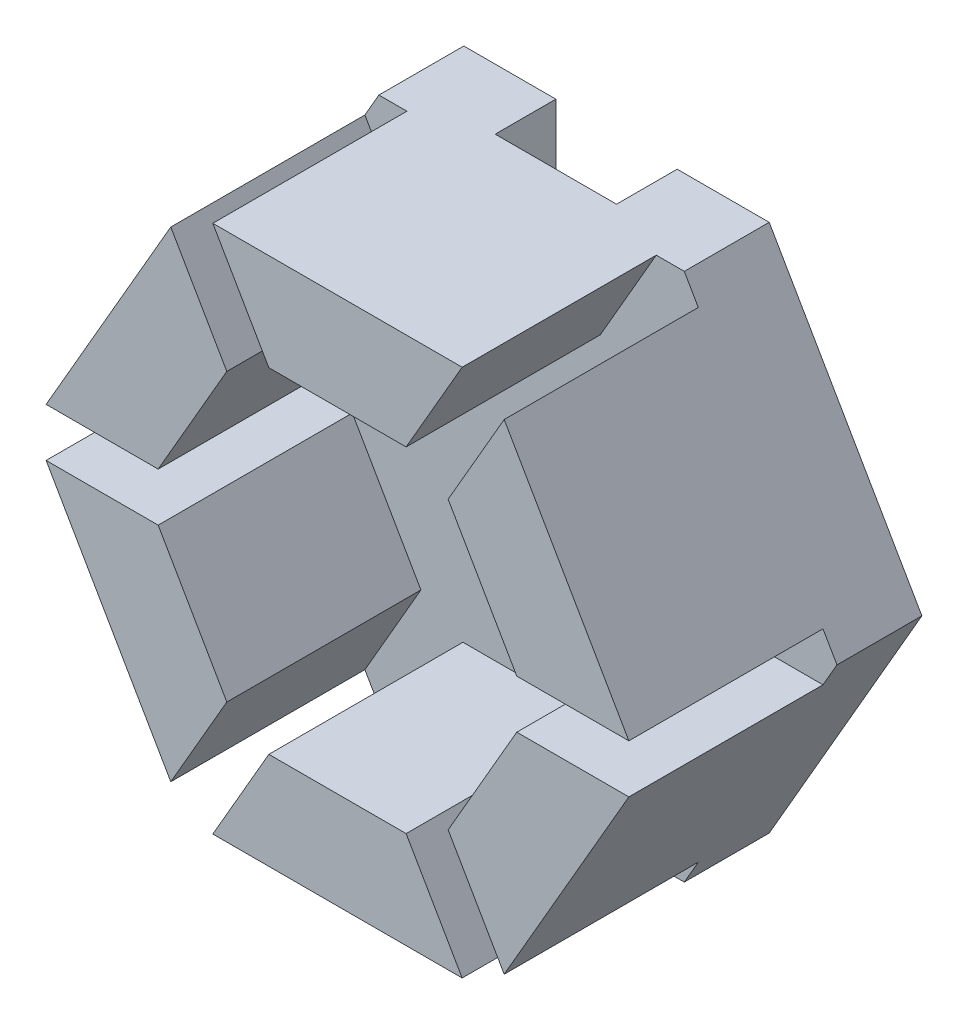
ISO-10303-21;
HEADER;
FILE_DESCRIPTION(('STEP AP214'),'2;1');
FILE_NAME('part.step','',(''),(''),'','','');
FILE_SCHEMA(('AUTOMOTIVE_DESIGN { 1 0 10303 214 1 1 1 1 }'));
ENDSEC;
DATA;
#1=APPLICATION_CONTEXT('core data for automotive mechanical design processes');
#2=APPLICATION_PROTOCOL_DEFINITION('international standard','automotive_design',2000,#1);
#3=PRODUCT_CONTEXT('',#1,'mechanical');
#4=PRODUCT('Part','Part','',(#3));
#5=PRODUCT_RELATED_PRODUCT_CATEGORY('part','',(#4));
#6=PRODUCT_DEFINITION_FORMATION('','',#4);
#7=PRODUCT_DEFINITION_CONTEXT('part definition',#1,'design');
#8=PRODUCT_DEFINITION('design','',#6,#7);
#9=PRODUCT_DEFINITION_SHAPE('','',#8);
#10=(LENGTH_UNIT() NAMED_UNIT(*) SI_UNIT(.MILLI.,.METRE.));
#11=(NAMED_UNIT(*) PLANE_ANGLE_UNIT() SI_UNIT($,.RADIAN.));
#12=(NAMED_UNIT(*) SI_UNIT($,.STERADIAN.) SOLID_ANGLE_UNIT());
#13=UNCERTAINTY_MEASURE_WITH_UNIT(LENGTH_MEASURE(1.E-05),#10,'distance_accuracy_value','');
#14=(GEOMETRIC_REPRESENTATION_CONTEXT(3) GLOBAL_UNCERTAINTY_ASSIGNED_CONTEXT((#13)) GLOBAL_UNIT_ASSIGNED_CONTEXT((#10,
#11,#12)) REPRESENTATION_CONTEXT('',''));
#15=CARTESIAN_POINT('',(0.,0.,0.));
#16=DIRECTION('',(0.,0.,1.));
#17=DIRECTION('',(1.,0.,0.));
#18=AXIS2_PLACEMENT_3D('',#15,#16,#17);
#19=CARTESIAN_POINT('',(0.,0.,4.));
#20=DIRECTION('',(0.,0.,1.));
#21=DIRECTION('',(1.,0.,0.));
#22=AXIS2_PLACEMENT_3D('',#19,#20,#21);
#23=PLANE('',#22);
#24=DIRECTION('',(-0.499999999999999,-0.866025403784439,0.));
#25=VECTOR('',#24,1.);
#26=CARTESIAN_POINT('',(-3.43523410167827,-4.95000000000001,4.));
#27=LINE('',#26,#25);
#28=CARTESIAN_POINT('',(-2.28053356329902,-2.95,4.));
#29=VERTEX_POINT('',#28);
#30=CARTESIAN_POINT('',(-3.43523410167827,-4.95000000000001,4.));
#31=VERTEX_POINT('',#30);
#32=EDGE_CURVE('E265',#29,#31,#27,.T.);
#33=ORIENTED_EDGE('',*,*,#32,.F.);
#34=DIRECTION('',(0.5,-0.866025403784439,0.));
#35=VECTOR('',#34,1.);
#36=CARTESIAN_POINT('',(-3.98371685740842,0.,4.));
#37=LINE('',#36,#35);
#38=CARTESIAN_POINT('',(-3.69504172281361,-0.5,4.));
#39=VERTEX_POINT('',#38);
#40=EDGE_CURVE('E342',#39,#29,#37,.T.);
#41=ORIENTED_EDGE('',*,*,#40,.F.);
#42=DIRECTION('',(1.,0.,0.));
#43=VECTOR('',#42,1.);
#44=CARTESIAN_POINT('',(-6.00444279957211,-0.500000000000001,4.));
#45=LINE('',#44,#43);
#46=CARTESIAN_POINT('',(-6.00444279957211,-0.500000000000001,4.));
#47=VERTEX_POINT('',#46);
#48=EDGE_CURVE('E478',#47,#39,#45,.T.);
#49=ORIENTED_EDGE('',*,*,#48,.F.);
#50=DIRECTION('',(0.5,-0.866025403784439,0.));
#51=VECTOR('',#50,1.);
#52=CARTESIAN_POINT('',(-6.29311793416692,0.,4.));
#53=LINE('',#52,#51);
#54=EDGE_CURVE('E365',#47,#31,#53,.T.);
#55=ORIENTED_EDGE('',*,*,#54,.T.);
#56=EDGE_LOOP('',(#33,#41,#49,#55));
#57=FACE_BOUND('',#56,.T.);
#58=ADVANCED_FACE('F37',(#57),#23,.T.);
#59=DIRECTION('',(0.499999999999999,0.866025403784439,0.));
#60=VECTOR('',#59,1.);
#61=CARTESIAN_POINT('',(-2.56920869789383,-5.45000000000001,4.));
#62=LINE('',#61,#60);
#63=CARTESIAN_POINT('',(-2.56920869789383,-5.45000000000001,4.));
#64=VERTEX_POINT('',#63);
#65=CARTESIAN_POINT('',(-1.41450815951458,-3.45,4.));
#66=VERTEX_POINT('',#65);
#67=EDGE_CURVE('E605',#64,#66,#62,.T.);
#68=ORIENTED_EDGE('',*,*,#67,.F.);
#69=DIRECTION('',(1.,0.,0.));
#70=VECTOR('',#69,1.);
#71=CARTESIAN_POINT('',(-3.14655896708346,-5.45,4.));
#72=LINE('',#71,#70);
#73=CARTESIAN_POINT('',(2.56920869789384,-5.45,4.));
#74=VERTEX_POINT('',#73);
#75=EDGE_CURVE('E368',#64,#74,#72,.T.);
#76=ORIENTED_EDGE('',*,*,#75,.T.);
#77=DIRECTION('',(0.5,-0.866025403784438,0.));
#78=VECTOR('',#77,1.);
#79=CARTESIAN_POINT('',(2.56920869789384,-5.45,4.));
#80=LINE('',#79,#78);
#81=CARTESIAN_POINT('',(1.41450815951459,-3.45,4.));
#82=VERTEX_POINT('',#81);
#83=EDGE_CURVE('E573',#82,#74,#80,.T.);
#84=ORIENTED_EDGE('',*,*,#83,.F.);
#85=DIRECTION('',(1.,0.,0.));
#86=VECTOR('',#85,1.);
#87=CARTESIAN_POINT('',(-1.99185842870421,-3.45,4.));
#88=LINE('',#87,#86);
#89=EDGE_CURVE('E345',#66,#82,#88,.T.);
#90=ORIENTED_EDGE('',*,*,#89,.F.);
#91=EDGE_LOOP('',(#68,#76,#84,#90));
#92=FACE_BOUND('',#91,.T.);
#93=ADVANCED_FACE('F540',(#92),#23,.T.);
#94=DIRECTION('',(0.5,0.866025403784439,0.));
#95=VECTOR('',#94,1.);
#96=CARTESIAN_POINT('',(3.43523410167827,4.95,4.));
#97=LINE('',#96,#95);
#98=CARTESIAN_POINT('',(2.28053356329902,2.95,4.));
#99=VERTEX_POINT('',#98);
#100=CARTESIAN_POINT('',(3.43523410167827,4.95,4.));
#101=VERTEX_POINT('',#100);
#102=EDGE_CURVE('E414',#99,#101,#97,.T.);
#103=ORIENTED_EDGE('',*,*,#102,.F.);
#104=DIRECTION('',(-0.5,0.866025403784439,0.));
#105=VECTOR('',#104,1.);
#106=CARTESIAN_POINT('',(3.98371685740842,0.,4.));
#107=LINE('',#106,#105);
#108=CARTESIAN_POINT('',(3.69504172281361,0.500000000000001,4.));
#109=VERTEX_POINT('',#108);
#110=EDGE_CURVE('E334',#109,#99,#107,.T.);
#111=ORIENTED_EDGE('',*,*,#110,.F.);
#112=DIRECTION('',(-1.,0.,0.));
#113=VECTOR('',#112,1.);
#114=CARTESIAN_POINT('',(6.00444279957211,0.500000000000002,4.));
#115=LINE('',#114,#113);
#116=CARTESIAN_POINT('',(6.00444279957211,0.500000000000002,4.));
#117=VERTEX_POINT('',#116);
#118=EDGE_CURVE('E454',#117,#109,#115,.T.);
#119=ORIENTED_EDGE('',*,*,#118,.F.);
#120=DIRECTION('',(-0.5,0.866025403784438,0.));
#121=VECTOR('',#120,1.);
#122=CARTESIAN_POINT('',(6.29311793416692,0.,4.));
#123=LINE('',#122,#121);
#124=EDGE_CURVE('E347',#117,#101,#123,.T.);
#125=ORIENTED_EDGE('',*,*,#124,.T.);
#126=EDGE_LOOP('',(#103,#111,#119,#125));
#127=FACE_BOUND('',#126,.T.);
#128=ADVANCED_FACE('F547',(#127),#23,.T.);
#129=DIRECTION('',(-0.5,-0.866025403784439,0.));
#130=VECTOR('',#129,1.);
#131=CARTESIAN_POINT('',(2.56920869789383,5.45,4.));
#132=LINE('',#131,#130);
#133=CARTESIAN_POINT('',(2.56920869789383,5.45,4.));
#134=VERTEX_POINT('',#133);
#135=CARTESIAN_POINT('',(1.41450815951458,3.45,4.));
#136=VERTEX_POINT('',#135);
#137=EDGE_CURVE('E418',#134,#136,#132,.T.);
#138=ORIENTED_EDGE('',*,*,#137,.F.);
#139=DIRECTION('',(-1.,0.,0.));
#140=VECTOR('',#139,1.);
#141=CARTESIAN_POINT('',(3.14655896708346,5.45,4.));
#142=LINE('',#141,#140);
#143=CARTESIAN_POINT('',(-2.56920869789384,5.45,4.));
#144=VERTEX_POINT('',#143);
#145=EDGE_CURVE('E361',#134,#144,#142,.T.);
#146=ORIENTED_EDGE('',*,*,#145,.T.);
#147=DIRECTION('',(-0.5,0.866025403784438,0.));
#148=VECTOR('',#147,1.);
#149=CARTESIAN_POINT('',(-2.56920869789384,5.45,4.));
#150=LINE('',#149,#148);
#151=CARTESIAN_POINT('',(-1.41450815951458,3.45,4.));
#152=VERTEX_POINT('',#151);
#153=EDGE_CURVE('E440',#152,#144,#150,.T.);
#154=ORIENTED_EDGE('',*,*,#153,.F.);
#155=DIRECTION('',(-1.,0.,0.));
#156=VECTOR('',#155,1.);
#157=CARTESIAN_POINT('',(1.99185842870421,3.45,4.));
#158=LINE('',#157,#156);
#159=EDGE_CURVE('E338',#136,#152,#158,.T.);
#160=ORIENTED_EDGE('',*,*,#159,.F.);
#161=EDGE_LOOP('',(#138,#146,#154,#160));
#162=FACE_BOUND('',#161,.T.);
#163=ADVANCED_FACE('F561',(#162),#23,.T.);
#164=DIRECTION('',(-0.500000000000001,0.866025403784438,0.));
#165=VECTOR('',#164,1.);
#166=CARTESIAN_POINT('',(3.43523410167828,-4.95,4.));
#167=LINE('',#166,#165);
#168=CARTESIAN_POINT('',(3.43523410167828,-4.95,4.));
#169=VERTEX_POINT('',#168);
#170=CARTESIAN_POINT('',(2.28053356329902,-2.95,4.));
#171=VERTEX_POINT('',#170);
#172=EDGE_CURVE('E569',#169,#171,#167,.T.);
#173=ORIENTED_EDGE('',*,*,#172,.F.);
#174=DIRECTION('',(0.5,0.866025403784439,0.));
#175=VECTOR('',#174,1.);
#176=CARTESIAN_POINT('',(3.14655896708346,-5.45,4.));
#177=LINE('',#176,#175);
#178=CARTESIAN_POINT('',(6.00444279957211,-0.499999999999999,4.));
#179=VERTEX_POINT('',#178);
#180=EDGE_CURVE('E370',#169,#179,#177,.T.);
#181=ORIENTED_EDGE('',*,*,#180,.T.);
#182=DIRECTION('',(1.,0.,0.));
#183=VECTOR('',#182,1.);
#184=CARTESIAN_POINT('',(6.00444279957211,-0.499999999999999,4.));
#185=LINE('',#184,#183);
#186=CARTESIAN_POINT('',(3.69504172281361,-0.499999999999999,4.));
#187=VERTEX_POINT('',#186);
#188=EDGE_CURVE('E464',#187,#179,#185,.T.);
#189=ORIENTED_EDGE('',*,*,#188,.F.);
#190=DIRECTION('',(0.5,0.866025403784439,0.));
#191=VECTOR('',#190,1.);
#192=CARTESIAN_POINT('',(1.99185842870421,-3.45,4.));
#193=LINE('',#192,#191);
#194=EDGE_CURVE('E332',#171,#187,#193,.T.);
#195=ORIENTED_EDGE('',*,*,#194,.F.);
#196=EDGE_LOOP('',(#173,#181,#189,#195));
#197=FACE_BOUND('',#196,.T.);
#198=ADVANCED_FACE('F554',(#197),#23,.T.);
#199=CARTESIAN_POINT('',(0.,0.,-1.75));
#200=DIRECTION('',(0.,0.,-1.));
#201=DIRECTION('',(-1.,0.,0.));
#202=AXIS2_PLACEMENT_3D('',#199,#200,#201);
#203=PLANE('',#202);
#204=DIRECTION('',(0.,-1.,0.));
#205=VECTOR('',#204,1.);
#206=CARTESIAN_POINT('',(1.25,5.45,-1.75));
#207=LINE('',#206,#205);
#208=CARTESIAN_POINT('',(1.25,5.45,-1.75));
#209=VERTEX_POINT('',#208);
#210=CARTESIAN_POINT('',(1.25,-5.45,-1.75));
#211=VERTEX_POINT('',#210);
#212=EDGE_CURVE('E399',#209,#211,#207,.T.);
#213=ORIENTED_EDGE('',*,*,#212,.F.);
#214=DIRECTION('',(1.,0.,0.));
#215=VECTOR('',#214,1.);
#216=CARTESIAN_POINT('',(-3.14655896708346,5.45,-1.75));
#217=LINE('',#216,#215);
#218=CARTESIAN_POINT('',(3.14655896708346,5.45,-1.75));
#219=VERTEX_POINT('',#218);
#220=EDGE_CURVE('E314',#209,#219,#217,.T.);
#221=ORIENTED_EDGE('',*,*,#220,.T.);
#222=DIRECTION('',(0.5,-0.866025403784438,0.));
#223=VECTOR('',#222,1.);
#224=CARTESIAN_POINT('',(3.14655896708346,5.45,-1.75));
#225=LINE('',#224,#223);
#226=CARTESIAN_POINT('',(6.29311793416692,0.,-1.75));
#227=VERTEX_POINT('',#226);
#228=EDGE_CURVE('E313',#219,#227,#225,.T.);
#229=ORIENTED_EDGE('',*,*,#228,.T.);
#230=DIRECTION('',(-0.5,-0.866025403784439,0.));
#231=VECTOR('',#230,1.);
#232=CARTESIAN_POINT('',(6.29311793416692,0.,-1.75));
#233=LINE('',#232,#231);
#234=CARTESIAN_POINT('',(3.14655896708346,-5.45,-1.75));
#235=VERTEX_POINT('',#234);
#236=EDGE_CURVE('E317',#227,#235,#233,.T.);
#237=ORIENTED_EDGE('',*,*,#236,.T.);
#238=DIRECTION('',(-1.,0.,0.));
#239=VECTOR('',#238,1.);
#240=CARTESIAN_POINT('',(3.14655896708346,-5.45,-1.75));
#241=LINE('',#240,#239);
#242=EDGE_CURVE('E328',#235,#211,#241,.T.);
#243=ORIENTED_EDGE('',*,*,#242,.T.);
#244=EDGE_LOOP('',(#213,#221,#229,#237,#243));
#245=FACE_BOUND('',#244,.T.);
#246=ADVANCED_FACE('F385',(#245),#203,.T.);
#247=DIRECTION('',(0.500000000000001,-0.866025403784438,0.));
#248=VECTOR('',#247,1.);
#249=CARTESIAN_POINT('',(-3.43523410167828,4.95,4.));
#250=LINE('',#249,#248);
#251=CARTESIAN_POINT('',(-3.43523410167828,4.95,4.));
#252=VERTEX_POINT('',#251);
#253=CARTESIAN_POINT('',(-2.28053356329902,2.95,4.));
#254=VERTEX_POINT('',#253);
#255=EDGE_CURVE('E431',#252,#254,#250,.T.);
#256=ORIENTED_EDGE('',*,*,#255,.F.);
#257=DIRECTION('',(-0.5,-0.866025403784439,0.));
#258=VECTOR('',#257,1.);
#259=CARTESIAN_POINT('',(-3.14655896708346,5.45,4.));
#260=LINE('',#259,#258);
#261=CARTESIAN_POINT('',(-6.00444279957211,0.499999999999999,4.));
#262=VERTEX_POINT('',#261);
#263=EDGE_CURVE('E363',#252,#262,#260,.T.);
#264=ORIENTED_EDGE('',*,*,#263,.T.);
#265=DIRECTION('',(-1.,0.,0.));
#266=VECTOR('',#265,1.);
#267=CARTESIAN_POINT('',(-6.00444279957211,0.499999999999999,4.));
#268=LINE('',#267,#266);
#269=CARTESIAN_POINT('',(-3.69504172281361,0.499999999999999,4.));
#270=VERTEX_POINT('',#269);
#271=EDGE_CURVE('E489',#270,#262,#268,.T.);
#272=ORIENTED_EDGE('',*,*,#271,.F.);
#273=DIRECTION('',(-0.5,-0.866025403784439,0.));
#274=VECTOR('',#273,1.);
#275=CARTESIAN_POINT('',(-1.99185842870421,3.45,4.));
#276=LINE('',#275,#274);
#277=EDGE_CURVE('E340',#254,#270,#276,.T.);
#278=ORIENTED_EDGE('',*,*,#277,.F.);
#279=EDGE_LOOP('',(#256,#264,#272,#278));
#280=FACE_BOUND('',#279,.T.);
#281=ADVANCED_FACE('F543',(#280),#23,.T.);
#282=CARTESIAN_POINT('',(6.29311793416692,0.,4.));
#283=DIRECTION('',(-0.866025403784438,-0.5,0.));
#284=DIRECTION('',(0.5,-0.866025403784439,0.));
#285=AXIS2_PLACEMENT_3D('',#282,#283,#284);
#286=PLANE('',#285);
#287=DIRECTION('',(-0.500000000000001,0.866025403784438,0.));
#288=VECTOR('',#287,1.);
#289=CARTESIAN_POINT('',(3.43523410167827,4.95,0.));
#290=LINE('',#289,#288);
#291=CARTESIAN_POINT('',(3.43523410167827,4.95,0.));
#292=VERTEX_POINT('',#291);
#293=CARTESIAN_POINT('',(3.14655896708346,5.45,0.));
#294=VERTEX_POINT('',#293);
#295=EDGE_CURVE('E410',#292,#294,#290,.T.);
#296=ORIENTED_EDGE('',*,*,#295,.F.);
#297=DIRECTION('',(0.,0.,1.));
#298=VECTOR('',#297,1.);
#299=CARTESIAN_POINT('',(3.43523410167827,4.95,0.));
#300=LINE('',#299,#298);
#301=EDGE_CURVE('E412',#292,#101,#300,.T.);
#302=ORIENTED_EDGE('',*,*,#301,.T.);
#303=ORIENTED_EDGE('',*,*,#124,.F.);
#304=DIRECTION('',(0.,0.,1.));
#305=VECTOR('',#304,1.);
#306=CARTESIAN_POINT('',(6.00444279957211,0.500000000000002,0.));
#307=LINE('',#306,#305);
#308=CARTESIAN_POINT('',(6.00444279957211,0.500000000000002,0.));
#309=VERTEX_POINT('',#308);
#310=EDGE_CURVE('E471',#309,#117,#307,.T.);
#311=ORIENTED_EDGE('',*,*,#310,.F.);
#312=DIRECTION('',(-0.499999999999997,0.866025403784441,0.));
#313=VECTOR('',#312,1.);
#314=CARTESIAN_POINT('',(6.29311793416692,0.,0.));
#315=LINE('',#314,#313);
#316=CARTESIAN_POINT('',(6.29311793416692,0.,0.));
#317=VERTEX_POINT('',#316);
#318=EDGE_CURVE('E379',#317,#309,#315,.T.);
#319=ORIENTED_EDGE('',*,*,#318,.F.);
#320=DIRECTION('',(0.,0.,-1.));
#321=VECTOR('',#320,1.);
#322=CARTESIAN_POINT('',(6.29311793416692,0.,4.));
#323=LINE('',#322,#321);
#324=EDGE_CURVE('E283',#317,#227,#323,.T.);
#325=ORIENTED_EDGE('',*,*,#324,.T.);
#326=ORIENTED_EDGE('',*,*,#228,.F.);
#327=DIRECTION('',(0.,0.,-1.));
#328=VECTOR('',#327,1.);
#329=CARTESIAN_POINT('',(3.14655896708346,5.45,4.));
#330=LINE('',#329,#328);
#331=EDGE_CURVE('E11',#294,#219,#330,.T.);
#332=ORIENTED_EDGE('',*,*,#331,.F.);
#333=EDGE_LOOP('',(#296,#302,#303,#311,#319,#325,#326,#332));
#334=FACE_BOUND('',#333,.T.);
#335=ADVANCED_FACE('F39',(#334),#286,.F.);
#336=CARTESIAN_POINT('',(3.14655896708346,5.45,4.));
#337=DIRECTION('',(0.,-1.,0.));
#338=DIRECTION('',(1.,0.,0.));
#339=AXIS2_PLACEMENT_3D('',#336,#337,#338);
#340=PLANE('',#339);
#341=ORIENTED_EDGE('',*,*,#145,.F.);
#342=DIRECTION('',(0.,0.,1.));
#343=VECTOR('',#342,1.);
#344=CARTESIAN_POINT('',(2.56920869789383,5.45,0.));
#345=LINE('',#344,#343);
#346=CARTESIAN_POINT('',(2.56920869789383,5.45,0.));
#347=VERTEX_POINT('',#346);
#348=EDGE_CURVE('E427',#347,#134,#345,.T.);
#349=ORIENTED_EDGE('',*,*,#348,.F.);
#350=DIRECTION('',(-1.,0.,0.));
#351=VECTOR('',#350,1.);
#352=CARTESIAN_POINT('',(3.14655896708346,5.45,0.));
#353=LINE('',#352,#351);
#354=EDGE_CURVE('E408',#294,#347,#353,.T.);
#355=ORIENTED_EDGE('',*,*,#354,.F.);
#356=ORIENTED_EDGE('',*,*,#331,.T.);
#357=ORIENTED_EDGE('',*,*,#220,.F.);
#358=DIRECTION('',(0.,0.,-1.));
#359=VECTOR('',#358,1.);
#360=CARTESIAN_POINT('',(1.25,5.45,-0.5));
#361=LINE('',#360,#359);
#362=CARTESIAN_POINT('',(1.25,5.45,-0.5));
#363=VERTEX_POINT('',#362);
#364=EDGE_CURVE('E320',#363,#209,#361,.T.);
#365=ORIENTED_EDGE('',*,*,#364,.F.);
#366=DIRECTION('',(1.,0.,0.));
#367=VECTOR('',#366,1.);
#368=CARTESIAN_POINT('',(1.25,5.45,-0.5));
#369=LINE('',#368,#367);
#370=CARTESIAN_POINT('',(-1.25,5.45,-0.5));
#371=VERTEX_POINT('',#370);
#372=EDGE_CURVE('E519',#371,#363,#369,.T.);
#373=ORIENTED_EDGE('',*,*,#372,.F.);
#374=DIRECTION('',(0.,0.,-1.));
#375=VECTOR('',#374,1.);
#376=CARTESIAN_POINT('',(-1.25,5.45,-0.5));
#377=LINE('',#376,#375);
#378=CARTESIAN_POINT('',(-1.25,5.45,-1.75));
#379=VERTEX_POINT('',#378);
#380=EDGE_CURVE('E312',#371,#379,#377,.T.);
#381=ORIENTED_EDGE('',*,*,#380,.T.);
#382=CARTESIAN_POINT('',(-3.14655896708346,5.45,-1.75));
#383=VERTEX_POINT('',#382);
#384=EDGE_CURVE('E305',#383,#379,#217,.T.);
#385=ORIENTED_EDGE('',*,*,#384,.F.);
#386=DIRECTION('',(0.,0.,-1.));
#387=VECTOR('',#386,1.);
#388=CARTESIAN_POINT('',(-3.14655896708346,5.45,4.));
#389=LINE('',#388,#387);
#390=CARTESIAN_POINT('',(-3.14655896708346,5.45,0.));
#391=VERTEX_POINT('',#390);
#392=EDGE_CURVE('E45',#391,#383,#389,.T.);
#393=ORIENTED_EDGE('',*,*,#392,.F.);
#394=DIRECTION('',(-1.,0.,0.));
#395=VECTOR('',#394,1.);
#396=CARTESIAN_POINT('',(-2.56920869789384,5.45,0.));
#397=LINE('',#396,#395);
#398=CARTESIAN_POINT('',(-2.56920869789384,5.45,0.));
#399=VERTEX_POINT('',#398);
#400=EDGE_CURVE('E438',#399,#391,#397,.T.);
#401=ORIENTED_EDGE('',*,*,#400,.F.);
#402=DIRECTION('',(0.,0.,1.));
#403=VECTOR('',#402,1.);
#404=CARTESIAN_POINT('',(-2.56920869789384,5.45,0.));
#405=LINE('',#404,#403);
#406=EDGE_CURVE('E451',#399,#144,#405,.T.);
#407=ORIENTED_EDGE('',*,*,#406,.T.);
#408=EDGE_LOOP('',(#341,#349,#355,#356,#357,#365,#373,#381,#385,#393,#401,#407));
#409=FACE_BOUND('',#408,.T.);
#410=ADVANCED_FACE('F310',(#409),#340,.F.);
#411=CARTESIAN_POINT('',(-3.14655896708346,5.45,4.));
#412=DIRECTION('',(0.866025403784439,-0.5,0.));
#413=DIRECTION('',(0.5,0.866025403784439,0.));
#414=AXIS2_PLACEMENT_3D('',#411,#412,#413);
#415=PLANE('',#414);
#416=ORIENTED_EDGE('',*,*,#263,.F.);
#417=DIRECTION('',(0.,0.,1.));
#418=VECTOR('',#417,1.);
#419=CARTESIAN_POINT('',(-3.43523410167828,4.95,0.));
#420=LINE('',#419,#418);
#421=CARTESIAN_POINT('',(-3.43523410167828,4.95,0.));
#422=VERTEX_POINT('',#421);
#423=EDGE_CURVE('E447',#422,#252,#420,.T.);
#424=ORIENTED_EDGE('',*,*,#423,.F.);
#425=DIRECTION('',(-0.500000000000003,-0.866025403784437,0.));
#426=VECTOR('',#425,1.);
#427=CARTESIAN_POINT('',(-3.14655896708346,5.45,0.));
#428=LINE('',#427,#426);
#429=EDGE_CURVE('E297',#391,#422,#428,.T.);
#430=ORIENTED_EDGE('',*,*,#429,.F.);
#431=ORIENTED_EDGE('',*,*,#392,.T.);
#432=DIRECTION('',(0.5,0.866025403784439,0.));
#433=VECTOR('',#432,1.);
#434=CARTESIAN_POINT('',(-6.29311793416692,0.,-1.75));
#435=LINE('',#434,#433);
#436=CARTESIAN_POINT('',(-6.29311793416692,0.,-1.75));
#437=VERTEX_POINT('',#436);
#438=EDGE_CURVE('E294',#437,#383,#435,.T.);
#439=ORIENTED_EDGE('',*,*,#438,.F.);
#440=DIRECTION('',(0.,0.,-1.));
#441=VECTOR('',#440,1.);
#442=CARTESIAN_POINT('',(-6.29311793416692,0.,4.));
#443=LINE('',#442,#441);
#444=CARTESIAN_POINT('',(-6.29311793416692,0.,0.));
#445=VERTEX_POINT('',#444);
#446=EDGE_CURVE('E279',#445,#437,#443,.T.);
#447=ORIENTED_EDGE('',*,*,#446,.F.);
#448=DIRECTION('',(-0.499999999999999,-0.866025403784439,0.));
#449=VECTOR('',#448,1.);
#450=CARTESIAN_POINT('',(-6.00444279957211,0.499999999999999,0.));
#451=LINE('',#450,#449);
#452=CARTESIAN_POINT('',(-6.00444279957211,0.499999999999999,0.));
#453=VERTEX_POINT('',#452);
#454=EDGE_CURVE('E486',#453,#445,#451,.T.);
#455=ORIENTED_EDGE('',*,*,#454,.F.);
#456=DIRECTION('',(0.,0.,1.));
#457=VECTOR('',#456,1.);
#458=CARTESIAN_POINT('',(-6.00444279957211,0.499999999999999,0.));
#459=LINE('',#458,#457);
#460=EDGE_CURVE('E402',#453,#262,#459,.T.);
#461=ORIENTED_EDGE('',*,*,#460,.T.);
#462=EDGE_LOOP('',(#416,#424,#430,#431,#439,#447,#455,#461));
#463=FACE_BOUND('',#462,.T.);
#464=ADVANCED_FACE('F292',(#463),#415,.F.);
#465=CARTESIAN_POINT('',(-6.29311793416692,0.,4.));
#466=DIRECTION('',(0.866025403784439,0.5,0.));
#467=DIRECTION('',(-0.5,0.866025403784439,0.));
#468=AXIS2_PLACEMENT_3D('',#465,#466,#467);
#469=PLANE('',#468);
#470=DIRECTION('',(0.500000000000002,-0.866025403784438,0.));
#471=VECTOR('',#470,1.);
#472=CARTESIAN_POINT('',(-3.43523410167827,-4.95000000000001,0.));
#473=LINE('',#472,#471);
#474=CARTESIAN_POINT('',(-3.43523410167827,-4.95000000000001,0.));
#475=VERTEX_POINT('',#474);
#476=CARTESIAN_POINT('',(-3.14655896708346,-5.45,0.));
#477=VERTEX_POINT('',#476);
#478=EDGE_CURVE('E255',#475,#477,#473,.T.);
#479=ORIENTED_EDGE('',*,*,#478,.F.);
#480=DIRECTION('',(0.,0.,1.));
#481=VECTOR('',#480,1.);
#482=CARTESIAN_POINT('',(-3.43523410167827,-4.95000000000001,0.));
#483=LINE('',#482,#481);
#484=EDGE_CURVE('E574',#475,#31,#483,.T.);
#485=ORIENTED_EDGE('',*,*,#484,.T.);
#486=ORIENTED_EDGE('',*,*,#54,.F.);
#487=DIRECTION('',(0.,0.,1.));
#488=VECTOR('',#487,1.);
#489=CARTESIAN_POINT('',(-6.00444279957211,-0.500000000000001,0.));
#490=LINE('',#489,#488);
#491=CARTESIAN_POINT('',(-6.00444279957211,-0.500000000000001,0.));
#492=VERTEX_POINT('',#491);
#493=EDGE_CURVE('E497',#492,#47,#490,.T.);
#494=ORIENTED_EDGE('',*,*,#493,.F.);
#495=DIRECTION('',(0.499999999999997,-0.866025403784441,0.));
#496=VECTOR('',#495,1.);
#497=CARTESIAN_POINT('',(-6.29311793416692,0.,0.));
#498=LINE('',#497,#496);
#499=EDGE_CURVE('E488',#445,#492,#498,.T.);
#500=ORIENTED_EDGE('',*,*,#499,.F.);
#501=ORIENTED_EDGE('',*,*,#446,.T.);
#502=DIRECTION('',(-0.5,0.866025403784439,0.));
#503=VECTOR('',#502,1.);
#504=CARTESIAN_POINT('',(-3.14655896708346,-5.45,-1.75));
#505=LINE('',#504,#503);
#506=CARTESIAN_POINT('',(-3.14655896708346,-5.45,-1.75));
#507=VERTEX_POINT('',#506);
#508=EDGE_CURVE('E278',#507,#437,#505,.T.);
#509=ORIENTED_EDGE('',*,*,#508,.F.);
#510=DIRECTION('',(0.,0.,-1.));
#511=VECTOR('',#510,1.);
#512=CARTESIAN_POINT('',(-3.14655896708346,-5.45,4.));
#513=LINE('',#512,#511);
#514=EDGE_CURVE('E271',#477,#507,#513,.T.);
#515=ORIENTED_EDGE('',*,*,#514,.F.);
#516=EDGE_LOOP('',(#479,#485,#486,#494,#500,#501,#509,#515));
#517=FACE_BOUND('',#516,.T.);
#518=ADVANCED_FACE('F276',(#517),#469,.F.);
#519=CARTESIAN_POINT('',(-3.14655896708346,-5.45,4.));
#520=DIRECTION('',(0.,1.,0.));
#521=DIRECTION('',(0.,0.,1.));
#522=AXIS2_PLACEMENT_3D('',#519,#520,#521);
#523=PLANE('',#522);
#524=ORIENTED_EDGE('',*,*,#75,.F.);
#525=DIRECTION('',(0.,0.,1.));
#526=VECTOR('',#525,1.);
#527=CARTESIAN_POINT('',(-2.56920869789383,-5.45000000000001,0.));
#528=LINE('',#527,#526);
#529=CARTESIAN_POINT('',(-2.56920869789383,-5.45000000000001,0.));
#530=VERTEX_POINT('',#529);
#531=EDGE_CURVE('E273',#530,#64,#528,.T.);
#532=ORIENTED_EDGE('',*,*,#531,.F.);
#533=DIRECTION('',(1.,0.,0.));
#534=VECTOR('',#533,1.);
#535=CARTESIAN_POINT('',(-3.14655896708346,-5.45,0.));
#536=LINE('',#535,#534);
#537=EDGE_CURVE('E259',#477,#530,#536,.T.);
#538=ORIENTED_EDGE('',*,*,#537,.F.);
#539=ORIENTED_EDGE('',*,*,#514,.T.);
#540=CARTESIAN_POINT('',(-1.25,-5.45,-1.75));
#541=VERTEX_POINT('',#540);
#542=EDGE_CURVE('E327',#541,#507,#241,.T.);
#543=ORIENTED_EDGE('',*,*,#542,.F.);
#544=DIRECTION('',(0.,0.,-1.));
#545=VECTOR('',#544,1.);
#546=CARTESIAN_POINT('',(-1.25,-5.45,-0.5));
#547=LINE('',#546,#545);
#548=CARTESIAN_POINT('',(-1.25,-5.45,-0.5));
#549=VERTEX_POINT('',#548);
#550=EDGE_CURVE('E524',#549,#541,#547,.T.);
#551=ORIENTED_EDGE('',*,*,#550,.F.);
#552=DIRECTION('',(-1.,0.,0.));
#553=VECTOR('',#552,1.);
#554=CARTESIAN_POINT('',(1.25,-5.45,-0.5));
#555=LINE('',#554,#553);
#556=CARTESIAN_POINT('',(1.25,-5.45,-0.5));
#557=VERTEX_POINT('',#556);
#558=EDGE_CURVE('E513',#557,#549,#555,.T.);
#559=ORIENTED_EDGE('',*,*,#558,.F.);
#560=DIRECTION('',(0.,0.,-1.));
#561=VECTOR('',#560,1.);
#562=CARTESIAN_POINT('',(1.25,-5.45,-0.5));
#563=LINE('',#562,#561);
#564=EDGE_CURVE('E322',#557,#211,#563,.T.);
#565=ORIENTED_EDGE('',*,*,#564,.T.);
#566=ORIENTED_EDGE('',*,*,#242,.F.);
#567=DIRECTION('',(0.,0.,-1.));
#568=VECTOR('',#567,1.);
#569=CARTESIAN_POINT('',(3.14655896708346,-5.45,4.));
#570=LINE('',#569,#568);
#571=CARTESIAN_POINT('',(3.14655896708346,-5.45,0.));
#572=VERTEX_POINT('',#571);
#573=EDGE_CURVE('E280',#572,#235,#570,.T.);
#574=ORIENTED_EDGE('',*,*,#573,.F.);
#575=DIRECTION('',(1.,0.,0.));
#576=VECTOR('',#575,1.);
#577=CARTESIAN_POINT('',(2.56920869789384,-5.45,0.));
#578=LINE('',#577,#576);
#579=CARTESIAN_POINT('',(2.56920869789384,-5.45,0.));
#580=VERTEX_POINT('',#579);
#581=EDGE_CURVE('E396',#580,#572,#578,.T.);
#582=ORIENTED_EDGE('',*,*,#581,.F.);
#583=DIRECTION('',(0.,0.,1.));
#584=VECTOR('',#583,1.);
#585=CARTESIAN_POINT('',(2.56920869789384,-5.45,0.));
#586=LINE('',#585,#584);
#587=EDGE_CURVE('E428',#580,#74,#586,.T.);
#588=ORIENTED_EDGE('',*,*,#587,.T.);
#589=EDGE_LOOP('',(#524,#532,#538,#539,#543,#551,#559,#565,#566,#574,#582,#588));
#590=FACE_BOUND('',#589,.T.);
#591=ADVANCED_FACE('F269',(#590),#523,.F.);
#592=CARTESIAN_POINT('',(3.14655896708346,-5.45,4.));
#593=DIRECTION('',(-0.866025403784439,0.5,0.));
#594=DIRECTION('',(-0.5,-0.866025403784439,0.));
#595=AXIS2_PLACEMENT_3D('',#592,#593,#594);
#596=PLANE('',#595);
#597=ORIENTED_EDGE('',*,*,#180,.F.);
#598=DIRECTION('',(0.,0.,1.));
#599=VECTOR('',#598,1.);
#600=CARTESIAN_POINT('',(3.43523410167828,-4.95,0.));
#601=LINE('',#600,#599);
#602=CARTESIAN_POINT('',(3.43523410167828,-4.95,0.));
#603=VERTEX_POINT('',#602);
#604=EDGE_CURVE('E421',#603,#169,#601,.T.);
#605=ORIENTED_EDGE('',*,*,#604,.F.);
#606=DIRECTION('',(0.500000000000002,0.866025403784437,0.));
#607=VECTOR('',#606,1.);
#608=CARTESIAN_POINT('',(3.14655896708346,-5.45,0.));
#609=LINE('',#608,#607);
#610=EDGE_CURVE('E393',#572,#603,#609,.T.);
#611=ORIENTED_EDGE('',*,*,#610,.F.);
#612=ORIENTED_EDGE('',*,*,#573,.T.);
#613=ORIENTED_EDGE('',*,*,#236,.F.);
#614=ORIENTED_EDGE('',*,*,#324,.F.);
#615=DIRECTION('',(0.499999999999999,0.866025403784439,0.));
#616=VECTOR('',#615,1.);
#617=CARTESIAN_POINT('',(6.00444279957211,-0.499999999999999,0.));
#618=LINE('',#617,#616);
#619=CARTESIAN_POINT('',(6.00444279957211,-0.499999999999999,0.));
#620=VERTEX_POINT('',#619);
#621=EDGE_CURVE('E462',#620,#317,#618,.T.);
#622=ORIENTED_EDGE('',*,*,#621,.F.);
#623=DIRECTION('',(0.,0.,1.));
#624=VECTOR('',#623,1.);
#625=CARTESIAN_POINT('',(6.00444279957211,-0.499999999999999,0.));
#626=LINE('',#625,#624);
#627=EDGE_CURVE('E475',#620,#179,#626,.T.);
#628=ORIENTED_EDGE('',*,*,#627,.T.);
#629=EDGE_LOOP('',(#597,#605,#611,#612,#613,#614,#622,#628));
#630=FACE_BOUND('',#629,.T.);
#631=ADVANCED_FACE('F389',(#630),#596,.F.);
#632=CARTESIAN_POINT('',(1.99185842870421,-3.45,4.));
#633=DIRECTION('',(-0.866025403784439,0.5,0.));
#634=DIRECTION('',(-0.5,-0.866025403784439,0.));
#635=AXIS2_PLACEMENT_3D('',#632,#633,#634);
#636=PLANE('',#635);
#637=DIRECTION('',(0.,0.,1.));
#638=VECTOR('',#637,1.);
#639=CARTESIAN_POINT('',(2.28053356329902,-2.95,0.));
#640=LINE('',#639,#638);
#641=CARTESIAN_POINT('',(2.28053356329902,-2.95,0.));
#642=VERTEX_POINT('',#641);
#643=EDGE_CURVE('E583',#642,#171,#640,.T.);
#644=ORIENTED_EDGE('',*,*,#643,.T.);
#645=ORIENTED_EDGE('',*,*,#194,.T.);
#646=DIRECTION('',(0.,0.,1.));
#647=VECTOR('',#646,1.);
#648=CARTESIAN_POINT('',(3.69504172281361,-0.499999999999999,0.));
#649=LINE('',#648,#647);
#650=CARTESIAN_POINT('',(3.69504172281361,-0.499999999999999,0.));
#651=VERTEX_POINT('',#650);
#652=EDGE_CURVE('E479',#651,#187,#649,.T.);
#653=ORIENTED_EDGE('',*,*,#652,.F.);
#654=DIRECTION('',(0.5,0.866025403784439,0.));
#655=VECTOR('',#654,1.);
#656=CARTESIAN_POINT('',(1.99185842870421,-3.45,0.));
#657=LINE('',#656,#655);
#658=EDGE_CURVE('E306',#642,#651,#657,.T.);
#659=ORIENTED_EDGE('',*,*,#658,.F.);
#660=EDGE_LOOP('',(#644,#645,#653,#659));
#661=FACE_BOUND('',#660,.T.);
#662=ADVANCED_FACE('F582',(#661),#636,.T.);
#663=CARTESIAN_POINT('',(3.98371685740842,0.,4.));
#664=DIRECTION('',(-0.866025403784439,-0.5,0.));
#665=DIRECTION('',(0.5,-0.866025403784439,0.));
#666=AXIS2_PLACEMENT_3D('',#663,#664,#665);
#667=PLANE('',#666);
#668=DIRECTION('',(0.,0.,1.));
#669=VECTOR('',#668,1.);
#670=CARTESIAN_POINT('',(2.28053356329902,2.95,0.));
#671=LINE('',#670,#669);
#672=CARTESIAN_POINT('',(2.28053356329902,2.95,0.));
#673=VERTEX_POINT('',#672);
#674=EDGE_CURVE('E432',#673,#99,#671,.T.);
#675=ORIENTED_EDGE('',*,*,#674,.F.);
#676=DIRECTION('',(-0.5,0.866025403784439,0.));
#677=VECTOR('',#676,1.);
#678=CARTESIAN_POINT('',(3.98371685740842,0.,0.));
#679=LINE('',#678,#677);
#680=CARTESIAN_POINT('',(3.6950417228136,0.500000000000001,0.));
#681=VERTEX_POINT('',#680);
#682=EDGE_CURVE('E349',#681,#673,#679,.T.);
#683=ORIENTED_EDGE('',*,*,#682,.F.);
#684=DIRECTION('',(0.,0.,1.));
#685=VECTOR('',#684,1.);
#686=CARTESIAN_POINT('',(3.69504172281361,0.500000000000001,0.));
#687=LINE('',#686,#685);
#688=EDGE_CURVE('E482',#681,#109,#687,.T.);
#689=ORIENTED_EDGE('',*,*,#688,.T.);
#690=ORIENTED_EDGE('',*,*,#110,.T.);
#691=EDGE_LOOP('',(#675,#683,#689,#690));
#692=FACE_BOUND('',#691,.T.);
#693=ADVANCED_FACE('F757',(#692),#667,.T.);
#694=CARTESIAN_POINT('',(1.99185842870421,3.45,4.));
#695=DIRECTION('',(0.,-1.,0.));
#696=DIRECTION('',(1.,0.,0.));
#697=AXIS2_PLACEMENT_3D('',#694,#695,#696);
#698=PLANE('',#697);
#699=DIRECTION('',(0.,0.,1.));
#700=VECTOR('',#699,1.);
#701=CARTESIAN_POINT('',(1.41450815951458,3.45,0.));
#702=LINE('',#701,#700);
#703=CARTESIAN_POINT('',(1.41450815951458,3.45,0.));
#704=VERTEX_POINT('',#703);
#705=EDGE_CURVE('E434',#704,#136,#702,.T.);
#706=ORIENTED_EDGE('',*,*,#705,.T.);
#707=ORIENTED_EDGE('',*,*,#159,.T.);
#708=DIRECTION('',(0.,0.,1.));
#709=VECTOR('',#708,1.);
#710=CARTESIAN_POINT('',(-1.41450815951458,3.45,0.));
#711=LINE('',#710,#709);
#712=CARTESIAN_POINT('',(-1.41450815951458,3.45,0.));
#713=VERTEX_POINT('',#712);
#714=EDGE_CURVE('E455',#713,#152,#711,.T.);
#715=ORIENTED_EDGE('',*,*,#714,.F.);
#716=DIRECTION('',(-1.,0.,0.));
#717=VECTOR('',#716,1.);
#718=CARTESIAN_POINT('',(1.99185842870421,3.45,0.));
#719=LINE('',#718,#717);
#720=EDGE_CURVE('E352',#704,#713,#719,.T.);
#721=ORIENTED_EDGE('',*,*,#720,.F.);
#722=EDGE_LOOP('',(#706,#707,#715,#721));
#723=FACE_BOUND('',#722,.T.);
#724=ADVANCED_FACE('F755',(#723),#698,.T.);
#725=CARTESIAN_POINT('',(-1.99185842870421,3.45,4.));
#726=DIRECTION('',(0.866025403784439,-0.5,0.));
#727=DIRECTION('',(0.5,0.866025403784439,0.));
#728=AXIS2_PLACEMENT_3D('',#725,#726,#727);
#729=PLANE('',#728);
#730=DIRECTION('',(0.,0.,1.));
#731=VECTOR('',#730,1.);
#732=CARTESIAN_POINT('',(-2.28053356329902,2.95,0.));
#733=LINE('',#732,#731);
#734=CARTESIAN_POINT('',(-2.28053356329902,2.95,0.));
#735=VERTEX_POINT('',#734);
#736=EDGE_CURVE('E458',#735,#254,#733,.T.);
#737=ORIENTED_EDGE('',*,*,#736,.T.);
#738=ORIENTED_EDGE('',*,*,#277,.T.);
#739=DIRECTION('',(0.,0.,1.));
#740=VECTOR('',#739,1.);
#741=CARTESIAN_POINT('',(-3.69504172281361,0.499999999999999,0.));
#742=LINE('',#741,#740);
#743=CARTESIAN_POINT('',(-3.69504172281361,0.499999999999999,0.));
#744=VERTEX_POINT('',#743);
#745=EDGE_CURVE('E503',#744,#270,#742,.T.);
#746=ORIENTED_EDGE('',*,*,#745,.F.);
#747=DIRECTION('',(-0.5,-0.866025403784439,0.));
#748=VECTOR('',#747,1.);
#749=CARTESIAN_POINT('',(-1.99185842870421,3.45,0.));
#750=LINE('',#749,#748);
#751=EDGE_CURVE('E354',#735,#744,#750,.T.);
#752=ORIENTED_EDGE('',*,*,#751,.F.);
#753=EDGE_LOOP('',(#737,#738,#746,#752));
#754=FACE_BOUND('',#753,.T.);
#755=ADVANCED_FACE('F745',(#754),#729,.T.);
#756=CARTESIAN_POINT('',(-3.98371685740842,0.,4.));
#757=DIRECTION('',(0.866025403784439,0.5,0.));
#758=DIRECTION('',(-0.5,0.866025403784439,0.));
#759=AXIS2_PLACEMENT_3D('',#756,#757,#758);
#760=PLANE('',#759);
#761=DIRECTION('',(0.,0.,1.));
#762=VECTOR('',#761,1.);
#763=CARTESIAN_POINT('',(-2.28053356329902,-2.95,0.));
#764=LINE('',#763,#762);
#765=CARTESIAN_POINT('',(-2.28053356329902,-2.95,0.));
#766=VERTEX_POINT('',#765);
#767=EDGE_CURVE('E601',#766,#29,#764,.T.);
#768=ORIENTED_EDGE('',*,*,#767,.F.);
#769=DIRECTION('',(0.5,-0.866025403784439,0.));
#770=VECTOR('',#769,1.);
#771=CARTESIAN_POINT('',(-3.98371685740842,0.,0.));
#772=LINE('',#771,#770);
#773=CARTESIAN_POINT('',(-3.69504172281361,-0.5,0.));
#774=VERTEX_POINT('',#773);
#775=EDGE_CURVE('E356',#774,#766,#772,.T.);
#776=ORIENTED_EDGE('',*,*,#775,.F.);
#777=DIRECTION('',(0.,0.,1.));
#778=VECTOR('',#777,1.);
#779=CARTESIAN_POINT('',(-3.69504172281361,-0.5,0.));
#780=LINE('',#779,#778);
#781=EDGE_CURVE('E506',#774,#39,#780,.T.);
#782=ORIENTED_EDGE('',*,*,#781,.T.);
#783=ORIENTED_EDGE('',*,*,#40,.T.);
#784=EDGE_LOOP('',(#768,#776,#782,#783));
#785=FACE_BOUND('',#784,.T.);
#786=ADVANCED_FACE('F736',(#785),#760,.T.);
#787=CARTESIAN_POINT('',(-1.99185842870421,-3.45,4.));
#788=DIRECTION('',(0.,1.,0.));
#789=DIRECTION('',(-1.,0.,0.));
#790=AXIS2_PLACEMENT_3D('',#787,#788,#789);
#791=PLANE('',#790);
#792=DIRECTION('',(0.,0.,1.));
#793=VECTOR('',#792,1.);
#794=CARTESIAN_POINT('',(-1.41450815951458,-3.45,0.));
#795=LINE('',#794,#793);
#796=CARTESIAN_POINT('',(-1.41450815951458,-3.45,0.));
#797=VERTEX_POINT('',#796);
#798=EDGE_CURVE('E598',#797,#66,#795,.T.);
#799=ORIENTED_EDGE('',*,*,#798,.T.);
#800=ORIENTED_EDGE('',*,*,#89,.T.);
#801=DIRECTION('',(0.,0.,1.));
#802=VECTOR('',#801,1.);
#803=CARTESIAN_POINT('',(1.41450815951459,-3.45,0.));
#804=LINE('',#803,#802);
#805=CARTESIAN_POINT('',(1.41450815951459,-3.45,0.));
#806=VERTEX_POINT('',#805);
#807=EDGE_CURVE('E584',#806,#82,#804,.T.);
#808=ORIENTED_EDGE('',*,*,#807,.F.);
#809=DIRECTION('',(1.,0.,0.));
#810=VECTOR('',#809,1.);
#811=CARTESIAN_POINT('',(-1.99185842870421,-3.45,0.));
#812=LINE('',#811,#810);
#813=EDGE_CURVE('E335',#797,#806,#812,.T.);
#814=ORIENTED_EDGE('',*,*,#813,.F.);
#815=EDGE_LOOP('',(#799,#800,#808,#814));
#816=FACE_BOUND('',#815,.T.);
#817=ADVANCED_FACE('F614',(#816),#791,.T.);
#818=CARTESIAN_POINT('',(0.,0.,0.));
#819=DIRECTION('',(0.,0.,-1.));
#820=DIRECTION('',(-1.,0.,0.));
#821=AXIS2_PLACEMENT_3D('',#818,#819,#820);
#822=PLANE('',#821);
#823=ORIENTED_EDGE('',*,*,#775,.T.);
#824=DIRECTION('',(-0.499999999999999,-0.866025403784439,0.));
#825=VECTOR('',#824,1.);
#826=CARTESIAN_POINT('',(-3.43523410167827,-4.95000000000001,0.));
#827=LINE('',#826,#825);
#828=EDGE_CURVE('E261',#766,#475,#827,.T.);
#829=ORIENTED_EDGE('',*,*,#828,.T.);
#830=ORIENTED_EDGE('',*,*,#478,.T.);
#831=ORIENTED_EDGE('',*,*,#537,.T.);
#832=DIRECTION('',(0.499999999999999,0.866025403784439,0.));
#833=VECTOR('',#832,1.);
#834=CARTESIAN_POINT('',(-2.56920869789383,-5.45000000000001,0.));
#835=LINE('',#834,#833);
#836=EDGE_CURVE('E52',#530,#797,#835,.T.);
#837=ORIENTED_EDGE('',*,*,#836,.T.);
#838=ORIENTED_EDGE('',*,*,#813,.T.);
#839=DIRECTION('',(0.5,-0.866025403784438,0.));
#840=VECTOR('',#839,1.);
#841=CARTESIAN_POINT('',(2.56920869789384,-5.45,0.));
#842=LINE('',#841,#840);
#843=EDGE_CURVE('E587',#806,#580,#842,.T.);
#844=ORIENTED_EDGE('',*,*,#843,.T.);
#845=ORIENTED_EDGE('',*,*,#581,.T.);
#846=ORIENTED_EDGE('',*,*,#610,.T.);
#847=DIRECTION('',(-0.500000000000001,0.866025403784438,0.));
#848=VECTOR('',#847,1.);
#849=CARTESIAN_POINT('',(3.43523410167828,-4.95,0.));
#850=LINE('',#849,#848);
#851=EDGE_CURVE('E59',#603,#642,#850,.T.);
#852=ORIENTED_EDGE('',*,*,#851,.T.);
#853=ORIENTED_EDGE('',*,*,#658,.T.);
#854=DIRECTION('',(1.,0.,0.));
#855=VECTOR('',#854,1.);
#856=CARTESIAN_POINT('',(6.00444279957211,-0.499999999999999,0.));
#857=LINE('',#856,#855);
#858=EDGE_CURVE('E468',#651,#620,#857,.T.);
#859=ORIENTED_EDGE('',*,*,#858,.T.);
#860=ORIENTED_EDGE('',*,*,#621,.T.);
#861=ORIENTED_EDGE('',*,*,#318,.T.);
#862=DIRECTION('',(-1.,0.,0.));
#863=VECTOR('',#862,1.);
#864=CARTESIAN_POINT('',(6.00444279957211,0.500000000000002,0.));
#865=LINE('',#864,#863);
#866=EDGE_CURVE('E466',#309,#681,#865,.T.);
#867=ORIENTED_EDGE('',*,*,#866,.T.);
#868=ORIENTED_EDGE('',*,*,#682,.T.);
#869=DIRECTION('',(0.5,0.866025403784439,0.));
#870=VECTOR('',#869,1.);
#871=CARTESIAN_POINT('',(3.43523410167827,4.95,0.));
#872=LINE('',#871,#870);
#873=EDGE_CURVE('E425',#673,#292,#872,.T.);
#874=ORIENTED_EDGE('',*,*,#873,.T.);
#875=ORIENTED_EDGE('',*,*,#295,.T.);
#876=ORIENTED_EDGE('',*,*,#354,.T.);
#877=DIRECTION('',(-0.5,-0.866025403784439,0.));
#878=VECTOR('',#877,1.);
#879=CARTESIAN_POINT('',(2.56920869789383,5.45,0.));
#880=LINE('',#879,#878);
#881=EDGE_CURVE('E416',#347,#704,#880,.T.);
#882=ORIENTED_EDGE('',*,*,#881,.T.);
#883=ORIENTED_EDGE('',*,*,#720,.T.);
#884=DIRECTION('',(-0.5,0.866025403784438,0.));
#885=VECTOR('',#884,1.);
#886=CARTESIAN_POINT('',(-2.56920869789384,5.45,0.));
#887=LINE('',#886,#885);
#888=EDGE_CURVE('E444',#713,#399,#887,.T.);
#889=ORIENTED_EDGE('',*,*,#888,.T.);
#890=ORIENTED_EDGE('',*,*,#400,.T.);
#891=ORIENTED_EDGE('',*,*,#429,.T.);
#892=DIRECTION('',(0.500000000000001,-0.866025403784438,0.));
#893=VECTOR('',#892,1.);
#894=CARTESIAN_POINT('',(-3.43523410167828,4.95,0.));
#895=LINE('',#894,#893);
#896=EDGE_CURVE('E442',#422,#735,#895,.T.);
#897=ORIENTED_EDGE('',*,*,#896,.T.);
#898=ORIENTED_EDGE('',*,*,#751,.T.);
#899=DIRECTION('',(-1.,0.,0.));
#900=VECTOR('',#899,1.);
#901=CARTESIAN_POINT('',(-6.00444279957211,0.499999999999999,0.));
#902=LINE('',#901,#900);
#903=EDGE_CURVE('E494',#744,#453,#902,.T.);
#904=ORIENTED_EDGE('',*,*,#903,.T.);
#905=ORIENTED_EDGE('',*,*,#454,.T.);
#906=ORIENTED_EDGE('',*,*,#499,.T.);
#907=DIRECTION('',(1.,0.,0.));
#908=VECTOR('',#907,1.);
#909=CARTESIAN_POINT('',(-6.00444279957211,-0.500000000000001,0.));
#910=LINE('',#909,#908);
#911=EDGE_CURVE('E492',#492,#774,#910,.T.);
#912=ORIENTED_EDGE('',*,*,#911,.T.);
#913=EDGE_LOOP('',(#823,#829,#830,#831,#837,#838,#844,#845,#846,#852,#853,#859,#860,#861,#867,
#868,#874,#875,#876,#882,#883,#889,#890,#891,#897,#898,#904,#905,#906,#912));
#914=FACE_BOUND('',#913,.T.);
#915=ADVANCED_FACE('F258',(#914),#822,.F.);
#916=DIRECTION('',(0.,1.,0.));
#917=VECTOR('',#916,1.);
#918=CARTESIAN_POINT('',(-1.25,5.45,-1.75));
#919=LINE('',#918,#917);
#920=EDGE_CURVE('E401',#541,#379,#919,.T.);
#921=ORIENTED_EDGE('',*,*,#920,.F.);
#922=ORIENTED_EDGE('',*,*,#542,.T.);
#923=ORIENTED_EDGE('',*,*,#508,.T.);
#924=ORIENTED_EDGE('',*,*,#438,.T.);
#925=ORIENTED_EDGE('',*,*,#384,.T.);
#926=EDGE_LOOP('',(#921,#922,#923,#924,#925));
#927=FACE_BOUND('',#926,.T.);
#928=ADVANCED_FACE('F304',(#927),#203,.T.);
#929=CARTESIAN_POINT('',(1.25,5.45,-0.5));
#930=DIRECTION('',(1.,0.,0.));
#931=DIRECTION('',(0.,0.,-1.));
#932=AXIS2_PLACEMENT_3D('',#929,#930,#931);
#933=PLANE('',#932);
#934=ORIENTED_EDGE('',*,*,#212,.T.);
#935=ORIENTED_EDGE('',*,*,#564,.F.);
#936=DIRECTION('',(0.,-1.,0.));
#937=VECTOR('',#936,1.);
#938=CARTESIAN_POINT('',(1.25,5.45,-0.5));
#939=LINE('',#938,#937);
#940=EDGE_CURVE('E510',#363,#557,#939,.T.);
#941=ORIENTED_EDGE('',*,*,#940,.F.);
#942=ORIENTED_EDGE('',*,*,#364,.T.);
#943=EDGE_LOOP('',(#934,#935,#941,#942));
#944=FACE_BOUND('',#943,.T.);
#945=ADVANCED_FACE('F530',(#944),#933,.F.);
#946=CARTESIAN_POINT('',(-1.25,5.45,-0.5));
#947=DIRECTION('',(-1.,0.,0.));
#948=DIRECTION('',(0.,0.,1.));
#949=AXIS2_PLACEMENT_3D('',#946,#947,#948);
#950=PLANE('',#949);
#951=ORIENTED_EDGE('',*,*,#920,.T.);
#952=ORIENTED_EDGE('',*,*,#380,.F.);
#953=DIRECTION('',(0.,1.,0.));
#954=VECTOR('',#953,1.);
#955=CARTESIAN_POINT('',(-1.25,5.45,-0.5));
#956=LINE('',#955,#954);
#957=EDGE_CURVE('E516',#549,#371,#956,.T.);
#958=ORIENTED_EDGE('',*,*,#957,.F.);
#959=ORIENTED_EDGE('',*,*,#550,.T.);
#960=EDGE_LOOP('',(#951,#952,#958,#959));
#961=FACE_BOUND('',#960,.T.);
#962=ADVANCED_FACE('F527',(#961),#950,.F.);
#963=CARTESIAN_POINT('',(0.,0.,-0.5));
#964=DIRECTION('',(0.,0.,-1.));
#965=DIRECTION('',(-1.,0.,0.));
#966=AXIS2_PLACEMENT_3D('',#963,#964,#965);
#967=PLANE('',#966);
#968=ORIENTED_EDGE('',*,*,#940,.T.);
#969=ORIENTED_EDGE('',*,*,#558,.T.);
#970=ORIENTED_EDGE('',*,*,#957,.T.);
#971=ORIENTED_EDGE('',*,*,#372,.T.);
#972=EDGE_LOOP('',(#968,#969,#970,#971));
#973=FACE_BOUND('',#972,.T.);
#974=ADVANCED_FACE('F529',(#973),#967,.T.);
#975=CARTESIAN_POINT('',(-6.00444279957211,0.499999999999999,0.));
#976=DIRECTION('',(0.,1.,0.));
#977=DIRECTION('',(-1.,0.,0.));
#978=AXIS2_PLACEMENT_3D('',#975,#976,#977);
#979=PLANE('',#978);
#980=ORIENTED_EDGE('',*,*,#271,.T.);
#981=ORIENTED_EDGE('',*,*,#460,.F.);
#982=ORIENTED_EDGE('',*,*,#903,.F.);
#983=ORIENTED_EDGE('',*,*,#745,.T.);
#984=EDGE_LOOP('',(#980,#981,#982,#983));
#985=FACE_BOUND('',#984,.T.);
#986=ADVANCED_FACE('F654',(#985),#979,.F.);
#987=CARTESIAN_POINT('',(-6.00444279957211,-0.500000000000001,0.));
#988=DIRECTION('',(0.,-1.,0.));
#989=DIRECTION('',(1.,0.,0.));
#990=AXIS2_PLACEMENT_3D('',#987,#988,#989);
#991=PLANE('',#990);
#992=ORIENTED_EDGE('',*,*,#48,.T.);
#993=ORIENTED_EDGE('',*,*,#781,.F.);
#994=ORIENTED_EDGE('',*,*,#911,.F.);
#995=ORIENTED_EDGE('',*,*,#493,.T.);
#996=EDGE_LOOP('',(#992,#993,#994,#995));
#997=FACE_BOUND('',#996,.T.);
#998=ADVANCED_FACE('F650',(#997),#991,.F.);
#999=CARTESIAN_POINT('',(6.00444279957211,-0.499999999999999,0.));
#1000=DIRECTION('',(0.,-1.,0.));
#1001=DIRECTION('',(1.,0.,0.));
#1002=AXIS2_PLACEMENT_3D('',#999,#1000,#1001);
#1003=PLANE('',#1002);
#1004=ORIENTED_EDGE('',*,*,#188,.T.);
#1005=ORIENTED_EDGE('',*,*,#627,.F.);
#1006=ORIENTED_EDGE('',*,*,#858,.F.);
#1007=ORIENTED_EDGE('',*,*,#652,.T.);
#1008=EDGE_LOOP('',(#1004,#1005,#1006,#1007));
#1009=FACE_BOUND('',#1008,.T.);
#1010=ADVANCED_FACE('F578',(#1009),#1003,.F.);
#1011=CARTESIAN_POINT('',(6.00444279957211,0.500000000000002,0.));
#1012=DIRECTION('',(0.,1.,0.));
#1013=DIRECTION('',(-1.,0.,0.));
#1014=AXIS2_PLACEMENT_3D('',#1011,#1012,#1013);
#1015=PLANE('',#1014);
#1016=ORIENTED_EDGE('',*,*,#118,.T.);
#1017=ORIENTED_EDGE('',*,*,#688,.F.);
#1018=ORIENTED_EDGE('',*,*,#866,.F.);
#1019=ORIENTED_EDGE('',*,*,#310,.T.);
#1020=EDGE_LOOP('',(#1016,#1017,#1018,#1019));
#1021=FACE_BOUND('',#1020,.T.);
#1022=ADVANCED_FACE('F643',(#1021),#1015,.F.);
#1023=CARTESIAN_POINT('',(-2.56920869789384,5.45,0.));
#1024=DIRECTION('',(0.866025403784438,0.5,0.));
#1025=DIRECTION('',(-0.5,0.866025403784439,0.));
#1026=AXIS2_PLACEMENT_3D('',#1023,#1024,#1025);
#1027=PLANE('',#1026);
#1028=ORIENTED_EDGE('',*,*,#153,.T.);
#1029=ORIENTED_EDGE('',*,*,#406,.F.);
#1030=ORIENTED_EDGE('',*,*,#888,.F.);
#1031=ORIENTED_EDGE('',*,*,#714,.T.);
#1032=EDGE_LOOP('',(#1028,#1029,#1030,#1031));
#1033=FACE_BOUND('',#1032,.T.);
#1034=ADVANCED_FACE('F640',(#1033),#1027,.F.);
#1035=CARTESIAN_POINT('',(-3.43523410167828,4.95,0.));
#1036=DIRECTION('',(-0.866025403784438,-0.500000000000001,0.));
#1037=DIRECTION('',(0.500000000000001,-0.866025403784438,0.));
#1038=AXIS2_PLACEMENT_3D('',#1035,#1036,#1037);
#1039=PLANE('',#1038);
#1040=ORIENTED_EDGE('',*,*,#255,.T.);
#1041=ORIENTED_EDGE('',*,*,#736,.F.);
#1042=ORIENTED_EDGE('',*,*,#896,.F.);
#1043=ORIENTED_EDGE('',*,*,#423,.T.);
#1044=EDGE_LOOP('',(#1040,#1041,#1042,#1043));
#1045=FACE_BOUND('',#1044,.T.);
#1046=ADVANCED_FACE('F637',(#1045),#1039,.F.);
#1047=CARTESIAN_POINT('',(3.43523410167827,4.95,0.));
#1048=DIRECTION('',(0.866025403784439,-0.5,0.));
#1049=DIRECTION('',(0.5,0.866025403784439,0.));
#1050=AXIS2_PLACEMENT_3D('',#1047,#1048,#1049);
#1051=PLANE('',#1050);
#1052=ORIENTED_EDGE('',*,*,#102,.T.);
#1053=ORIENTED_EDGE('',*,*,#301,.F.);
#1054=ORIENTED_EDGE('',*,*,#873,.F.);
#1055=ORIENTED_EDGE('',*,*,#674,.T.);
#1056=EDGE_LOOP('',(#1052,#1053,#1054,#1055));
#1057=FACE_BOUND('',#1056,.T.);
#1058=ADVANCED_FACE('F630',(#1057),#1051,.F.);
#1059=CARTESIAN_POINT('',(2.56920869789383,5.45,0.));
#1060=DIRECTION('',(-0.866025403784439,0.5,0.));
#1061=DIRECTION('',(-0.5,-0.866025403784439,0.));
#1062=AXIS2_PLACEMENT_3D('',#1059,#1060,#1061);
#1063=PLANE('',#1062);
#1064=ORIENTED_EDGE('',*,*,#137,.T.);
#1065=ORIENTED_EDGE('',*,*,#705,.F.);
#1066=ORIENTED_EDGE('',*,*,#881,.F.);
#1067=ORIENTED_EDGE('',*,*,#348,.T.);
#1068=EDGE_LOOP('',(#1064,#1065,#1066,#1067));
#1069=FACE_BOUND('',#1068,.T.);
#1070=ADVANCED_FACE('F622',(#1069),#1063,.F.);
#1071=CARTESIAN_POINT('',(2.56920869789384,-5.45,0.));
#1072=DIRECTION('',(-0.866025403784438,-0.5,0.));
#1073=DIRECTION('',(0.5,-0.866025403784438,0.));
#1074=AXIS2_PLACEMENT_3D('',#1071,#1072,#1073);
#1075=PLANE('',#1074);
#1076=ORIENTED_EDGE('',*,*,#83,.T.);
#1077=ORIENTED_EDGE('',*,*,#587,.F.);
#1078=ORIENTED_EDGE('',*,*,#843,.F.);
#1079=ORIENTED_EDGE('',*,*,#807,.T.);
#1080=EDGE_LOOP('',(#1076,#1077,#1078,#1079));
#1081=FACE_BOUND('',#1080,.T.);
#1082=ADVANCED_FACE('F618',(#1081),#1075,.F.);
#1083=CARTESIAN_POINT('',(3.43523410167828,-4.95,0.));
#1084=DIRECTION('',(0.866025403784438,0.500000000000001,0.));
#1085=DIRECTION('',(-0.500000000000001,0.866025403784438,0.));
#1086=AXIS2_PLACEMENT_3D('',#1083,#1084,#1085);
#1087=PLANE('',#1086);
#1088=ORIENTED_EDGE('',*,*,#172,.T.);
#1089=ORIENTED_EDGE('',*,*,#643,.F.);
#1090=ORIENTED_EDGE('',*,*,#851,.F.);
#1091=ORIENTED_EDGE('',*,*,#604,.T.);
#1092=EDGE_LOOP('',(#1088,#1089,#1090,#1091));
#1093=FACE_BOUND('',#1092,.T.);
#1094=ADVANCED_FACE('F621',(#1093),#1087,.F.);
#1095=CARTESIAN_POINT('',(-3.43523410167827,-4.95000000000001,0.));
#1096=DIRECTION('',(-0.866025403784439,0.499999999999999,0.));
#1097=DIRECTION('',(-0.499999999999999,-0.866025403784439,0.));
#1098=AXIS2_PLACEMENT_3D('',#1095,#1096,#1097);
#1099=PLANE('',#1098);
#1100=ORIENTED_EDGE('',*,*,#32,.T.);
#1101=ORIENTED_EDGE('',*,*,#484,.F.);
#1102=ORIENTED_EDGE('',*,*,#828,.F.);
#1103=ORIENTED_EDGE('',*,*,#767,.T.);
#1104=EDGE_LOOP('',(#1100,#1101,#1102,#1103));
#1105=FACE_BOUND('',#1104,.T.);
#1106=ADVANCED_FACE('F628',(#1105),#1099,.F.);
#1107=CARTESIAN_POINT('',(-2.56920869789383,-5.45000000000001,0.));
#1108=DIRECTION('',(0.866025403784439,-0.499999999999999,0.));
#1109=DIRECTION('',(0.499999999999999,0.866025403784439,0.));
#1110=AXIS2_PLACEMENT_3D('',#1107,#1108,#1109);
#1111=PLANE('',#1110);
#1112=ORIENTED_EDGE('',*,*,#67,.T.);
#1113=ORIENTED_EDGE('',*,*,#798,.F.);
#1114=ORIENTED_EDGE('',*,*,#836,.F.);
#1115=ORIENTED_EDGE('',*,*,#531,.T.);
#1116=EDGE_LOOP('',(#1112,#1113,#1114,#1115));
#1117=FACE_BOUND('',#1116,.T.);
#1118=ADVANCED_FACE('F610',(#1117),#1111,.F.);
#1119=CLOSED_SHELL('',(#58,#93,#128,#163,#198,#246,#281,#335,#410,#464,#518,#591,#631,#662,#693,
#724,#755,#786,#817,#915,#928,#945,#962,#974,#986,#998,#1010,#1022,#1034,#1046,#1058,#1070,
#1082,#1094,#1106,#1118));
#1120=MANIFOLD_SOLID_BREP('B2',#1119);
#1121=ADVANCED_BREP_SHAPE_REPRESENTATION('',(#18,#1120),#14);
#1122=SHAPE_DEFINITION_REPRESENTATION(#9,#1121);
ENDSEC;
END-ISO-10303-21;
